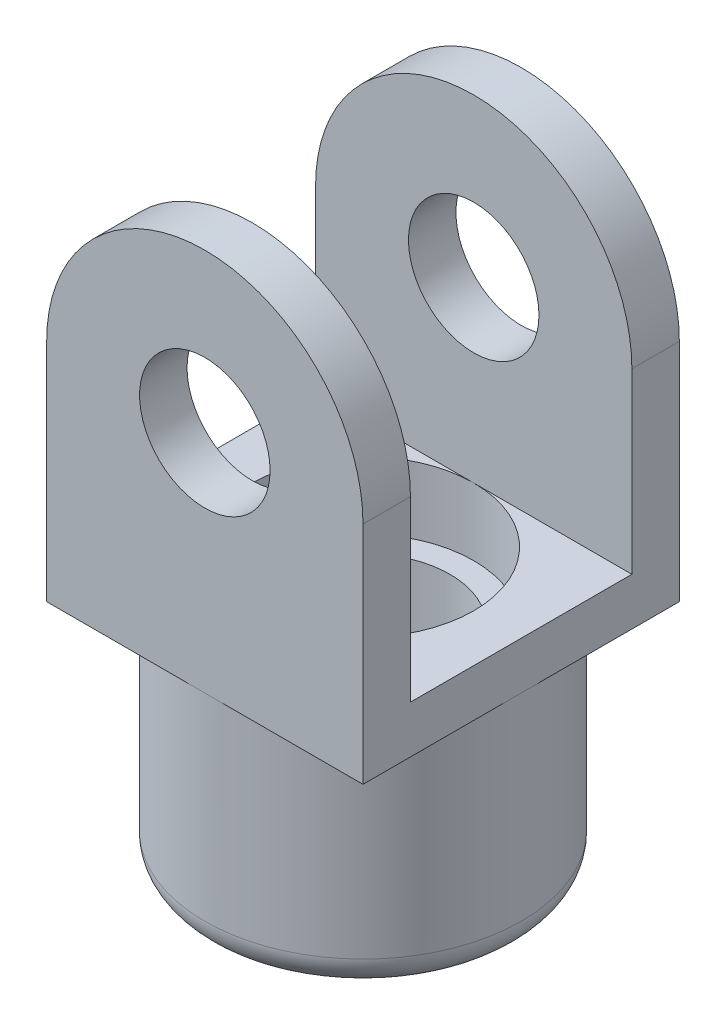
ISO-10303-21;
HEADER;
FILE_DESCRIPTION(('STEP AP214'),'2;1');
FILE_NAME('part.step','',(''),(''),'','','');
FILE_SCHEMA(('AUTOMOTIVE_DESIGN { 1 0 10303 214 1 1 1 1 }'));
ENDSEC;
DATA;
#1=APPLICATION_CONTEXT('core data for automotive mechanical design processes');
#2=APPLICATION_PROTOCOL_DEFINITION('international standard','automotive_design',2000,#1);
#3=PRODUCT_CONTEXT('',#1,'mechanical');
#4=PRODUCT('Part','Part','',(#3));
#5=PRODUCT_RELATED_PRODUCT_CATEGORY('part','',(#4));
#6=PRODUCT_DEFINITION_FORMATION('','',#4);
#7=PRODUCT_DEFINITION_CONTEXT('part definition',#1,'design');
#8=PRODUCT_DEFINITION('design','',#6,#7);
#9=PRODUCT_DEFINITION_SHAPE('','',#8);
#10=(LENGTH_UNIT() NAMED_UNIT(*) SI_UNIT(.MILLI.,.METRE.));
#11=(NAMED_UNIT(*) PLANE_ANGLE_UNIT() SI_UNIT($,.RADIAN.));
#12=(NAMED_UNIT(*) SI_UNIT($,.STERADIAN.) SOLID_ANGLE_UNIT());
#13=UNCERTAINTY_MEASURE_WITH_UNIT(LENGTH_MEASURE(1.E-05),#10,'distance_accuracy_value','');
#14=(GEOMETRIC_REPRESENTATION_CONTEXT(3) GLOBAL_UNCERTAINTY_ASSIGNED_CONTEXT((#13)) GLOBAL_UNIT_ASSIGNED_CONTEXT((#10,
#11,#12)) REPRESENTATION_CONTEXT('',''));
#15=CARTESIAN_POINT('',(0.,0.,0.));
#16=DIRECTION('',(0.,0.,1.));
#17=DIRECTION('',(1.,0.,0.));
#18=AXIS2_PLACEMENT_3D('',#15,#16,#17);
#19=CARTESIAN_POINT('',(0.,12.319,0.));
#20=DIRECTION('',(0.,-1.,0.));
#21=DIRECTION('',(1.,0.,0.));
#22=AXIS2_PLACEMENT_3D('',#19,#20,#21);
#23=CYLINDRICAL_SURFACE('',#22,2.794);
#24=CARTESIAN_POINT('',(0.,-0.634999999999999,0.));
#25=DIRECTION('',(0.,1.,0.));
#26=DIRECTION('',(-1.,0.,0.));
#27=AXIS2_PLACEMENT_3D('',#24,#25,#26);
#28=CIRCLE('',#27,2.794);
#29=CARTESIAN_POINT('',(-2.794,-0.634999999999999,0.));
#30=VERTEX_POINT('',#29);
#31=EDGE_CURVE('E204',#30,#30,#28,.F.);
#32=ORIENTED_EDGE('',*,*,#31,.F.);
#33=EDGE_LOOP('',(#32));
#34=FACE_BOUND('',#33,.T.);
#35=CARTESIAN_POINT('',(0.,-5.207,0.));
#36=DIRECTION('',(0.,-1.,0.));
#37=DIRECTION('',(1.,0.,0.));
#38=AXIS2_PLACEMENT_3D('',#35,#36,#37);
#39=CIRCLE('',#38,2.794);
#40=CARTESIAN_POINT('',(2.794,-5.207,0.));
#41=VERTEX_POINT('',#40);
#42=EDGE_CURVE('E114',#41,#41,#39,.F.);
#43=ORIENTED_EDGE('',*,*,#42,.F.);
#44=EDGE_LOOP('',(#43));
#45=FACE_BOUND('',#44,.T.);
#46=ADVANCED_FACE('F28',(#34,#45),#23,.F.);
#47=CARTESIAN_POINT('',(-5.08,1.524,5.08));
#48=DIRECTION('',(0.,1.,0.));
#49=DIRECTION('',(-1.,0.,0.));
#50=AXIS2_PLACEMENT_3D('',#47,#48,#49);
#51=PLANE('',#50);
#52=CARTESIAN_POINT('',(0.,1.524,0.));
#53=DIRECTION('',(0.,1.,0.));
#54=DIRECTION('',(-1.,0.,0.));
#55=AXIS2_PLACEMENT_3D('',#52,#53,#54);
#56=CIRCLE('',#55,3.556);
#57=CARTESIAN_POINT('',(0.,1.524,3.556));
#58=VERTEX_POINT('',#57);
#59=CARTESIAN_POINT('',(0.,1.524,-3.556));
#60=VERTEX_POINT('',#59);
#61=EDGE_CURVE('E42',#58,#60,#56,.T.);
#62=ORIENTED_EDGE('',*,*,#61,.F.);
#63=DIRECTION('',(1.,0.,0.));
#64=VECTOR('',#63,1.);
#65=CARTESIAN_POINT('',(0.,1.524,3.556));
#66=LINE('',#65,#64);
#67=CARTESIAN_POINT('',(5.08,1.524,3.556));
#68=VERTEX_POINT('',#67);
#69=EDGE_CURVE('E120',#58,#68,#66,.T.);
#70=ORIENTED_EDGE('',*,*,#69,.T.);
#71=DIRECTION('',(0.,0.,-1.));
#72=VECTOR('',#71,1.);
#73=CARTESIAN_POINT('',(5.08,1.524,5.08));
#74=LINE('',#73,#72);
#75=CARTESIAN_POINT('',(5.08,1.524,-3.556));
#76=VERTEX_POINT('',#75);
#77=EDGE_CURVE('E137',#68,#76,#74,.T.);
#78=ORIENTED_EDGE('',*,*,#77,.T.);
#79=DIRECTION('',(1.,0.,0.));
#80=VECTOR('',#79,1.);
#81=CARTESIAN_POINT('',(0.,1.524,-3.556));
#82=LINE('',#81,#80);
#83=EDGE_CURVE('E122',#60,#76,#82,.T.);
#84=ORIENTED_EDGE('',*,*,#83,.F.);
#85=EDGE_LOOP('',(#62,#70,#78,#84));
#86=FACE_BOUND('',#85,.T.);
#87=ADVANCED_FACE('F118',(#86),#51,.T.);
#88=CARTESIAN_POINT('',(-5.08,0.,5.08));
#89=DIRECTION('',(0.,1.,0.));
#90=DIRECTION('',(-1.,0.,0.));
#91=AXIS2_PLACEMENT_3D('',#88,#89,#90);
#92=PLANE('',#91);
#93=CARTESIAN_POINT('',(0.,0.,0.));
#94=DIRECTION('',(0.,-1.,0.));
#95=DIRECTION('',(1.,0.,0.));
#96=AXIS2_PLACEMENT_3D('',#93,#94,#95);
#97=CIRCLE('',#96,5.08);
#98=CARTESIAN_POINT('',(5.08,0.,0.));
#99=VERTEX_POINT('',#98);
#100=CARTESIAN_POINT('',(0.,0.,5.08));
#101=VERTEX_POINT('',#100);
#102=EDGE_CURVE('E207',#99,#101,#97,.T.);
#103=ORIENTED_EDGE('',*,*,#102,.F.);
#104=DIRECTION('',(0.,0.,-1.));
#105=VECTOR('',#104,1.);
#106=CARTESIAN_POINT('',(5.08,0.,5.08));
#107=LINE('',#106,#105);
#108=CARTESIAN_POINT('',(5.08,0.,5.08));
#109=VERTEX_POINT('',#108);
#110=EDGE_CURVE('E190',#109,#99,#107,.T.);
#111=ORIENTED_EDGE('',*,*,#110,.F.);
#112=DIRECTION('',(1.,0.,0.));
#113=VECTOR('',#112,1.);
#114=CARTESIAN_POINT('',(-5.08,0.,5.08));
#115=LINE('',#114,#113);
#116=EDGE_CURVE('E180',#101,#109,#115,.T.);
#117=ORIENTED_EDGE('',*,*,#116,.F.);
#118=EDGE_LOOP('',(#103,#111,#117));
#119=FACE_BOUND('',#118,.T.);
#120=ADVANCED_FACE('F261',(#119),#92,.F.);
#121=CARTESIAN_POINT('',(-5.08,0.,0.));
#122=VERTEX_POINT('',#121);
#123=EDGE_CURVE('E211',#101,#122,#97,.T.);
#124=ORIENTED_EDGE('',*,*,#123,.F.);
#125=CARTESIAN_POINT('',(-5.08,0.,5.08));
#126=VERTEX_POINT('',#125);
#127=EDGE_CURVE('E181',#126,#101,#115,.T.);
#128=ORIENTED_EDGE('',*,*,#127,.F.);
#129=DIRECTION('',(0.,0.,-1.));
#130=VECTOR('',#129,1.);
#131=CARTESIAN_POINT('',(-5.08,0.,5.08));
#132=LINE('',#131,#130);
#133=EDGE_CURVE('E185',#126,#122,#132,.T.);
#134=ORIENTED_EDGE('',*,*,#133,.T.);
#135=EDGE_LOOP('',(#124,#128,#134));
#136=FACE_BOUND('',#135,.T.);
#137=ADVANCED_FACE('F239',(#136),#92,.F.);
#138=CARTESIAN_POINT('',(0.,0.,-5.08));
#139=VERTEX_POINT('',#138);
#140=EDGE_CURVE('E50',#122,#139,#97,.T.);
#141=ORIENTED_EDGE('',*,*,#140,.F.);
#142=CARTESIAN_POINT('',(-5.08,0.,-5.08));
#143=VERTEX_POINT('',#142);
#144=EDGE_CURVE('E189',#122,#143,#132,.T.);
#145=ORIENTED_EDGE('',*,*,#144,.T.);
#146=DIRECTION('',(1.,0.,0.));
#147=VECTOR('',#146,1.);
#148=CARTESIAN_POINT('',(-5.08,0.,-5.08));
#149=LINE('',#148,#147);
#150=EDGE_CURVE('E169',#143,#139,#149,.T.);
#151=ORIENTED_EDGE('',*,*,#150,.T.);
#152=EDGE_LOOP('',(#141,#145,#151));
#153=FACE_BOUND('',#152,.T.);
#154=ADVANCED_FACE('F235',(#153),#92,.F.);
#155=EDGE_CURVE('E188',#139,#99,#97,.T.);
#156=ORIENTED_EDGE('',*,*,#155,.F.);
#157=CARTESIAN_POINT('',(5.08,0.,-5.08));
#158=VERTEX_POINT('',#157);
#159=EDGE_CURVE('E168',#139,#158,#149,.T.);
#160=ORIENTED_EDGE('',*,*,#159,.T.);
#161=EDGE_CURVE('E192',#99,#158,#107,.T.);
#162=ORIENTED_EDGE('',*,*,#161,.F.);
#163=EDGE_LOOP('',(#156,#160,#162));
#164=FACE_BOUND('',#163,.T.);
#165=ADVANCED_FACE('F229',(#164),#92,.F.);
#166=CARTESIAN_POINT('',(-5.08,0.,5.08));
#167=DIRECTION('',(-1.,0.,0.));
#168=DIRECTION('',(0.,-1.,0.));
#169=AXIS2_PLACEMENT_3D('',#166,#167,#168);
#170=PLANE('',#169);
#171=DIRECTION('',(0.,0.,-1.));
#172=VECTOR('',#171,1.);
#173=CARTESIAN_POINT('',(-5.08,1.524,5.08));
#174=LINE('',#173,#172);
#175=CARTESIAN_POINT('',(-5.08,1.524,3.556));
#176=VERTEX_POINT('',#175);
#177=CARTESIAN_POINT('',(-5.08,1.524,-3.556));
#178=VERTEX_POINT('',#177);
#179=EDGE_CURVE('E136',#176,#178,#174,.T.);
#180=ORIENTED_EDGE('',*,*,#179,.T.);
#181=DIRECTION('',(0.,1.,0.));
#182=VECTOR('',#181,1.);
#183=CARTESIAN_POINT('',(-5.08,7.239,-3.556));
#184=LINE('',#183,#182);
#185=CARTESIAN_POINT('',(-5.08,7.239,-3.556));
#186=VERTEX_POINT('',#185);
#187=EDGE_CURVE('E149',#178,#186,#184,.T.);
#188=ORIENTED_EDGE('',*,*,#187,.T.);
#189=DIRECTION('',(0.,0.,-1.));
#190=VECTOR('',#189,1.);
#191=CARTESIAN_POINT('',(-5.08,7.239,5.08));
#192=LINE('',#191,#190);
#193=CARTESIAN_POINT('',(-5.08,7.239,-5.08));
#194=VERTEX_POINT('',#193);
#195=EDGE_CURVE('E184',#186,#194,#192,.T.);
#196=ORIENTED_EDGE('',*,*,#195,.T.);
#197=DIRECTION('',(0.,1.,0.));
#198=VECTOR('',#197,1.);
#199=CARTESIAN_POINT('',(-5.08,0.,-5.08));
#200=LINE('',#199,#198);
#201=EDGE_CURVE('E154',#143,#194,#200,.T.);
#202=ORIENTED_EDGE('',*,*,#201,.F.);
#203=ORIENTED_EDGE('',*,*,#144,.F.);
#204=ORIENTED_EDGE('',*,*,#133,.F.);
#205=DIRECTION('',(0.,1.,0.));
#206=VECTOR('',#205,1.);
#207=CARTESIAN_POINT('',(-5.08,0.,5.08));
#208=LINE('',#207,#206);
#209=CARTESIAN_POINT('',(-5.08,7.239,5.08));
#210=VERTEX_POINT('',#209);
#211=EDGE_CURVE('E171',#126,#210,#208,.T.);
#212=ORIENTED_EDGE('',*,*,#211,.T.);
#213=CARTESIAN_POINT('',(-5.08,7.239,3.556));
#214=VERTEX_POINT('',#213);
#215=EDGE_CURVE('E197',#210,#214,#192,.T.);
#216=ORIENTED_EDGE('',*,*,#215,.T.);
#217=DIRECTION('',(0.,1.,0.));
#218=VECTOR('',#217,1.);
#219=CARTESIAN_POINT('',(-5.08,7.239,3.556));
#220=LINE('',#219,#218);
#221=EDGE_CURVE('E155',#176,#214,#220,.T.);
#222=ORIENTED_EDGE('',*,*,#221,.F.);
#223=EDGE_LOOP('',(#180,#188,#196,#202,#203,#204,#212,#216,#222));
#224=FACE_BOUND('',#223,.T.);
#225=ADVANCED_FACE('F30',(#224),#170,.T.);
#226=CARTESIAN_POINT('',(5.08,7.239,5.08));
#227=DIRECTION('',(1.,0.,0.));
#228=DIRECTION('',(0.,1.,0.));
#229=AXIS2_PLACEMENT_3D('',#226,#227,#228);
#230=PLANE('',#229);
#231=DIRECTION('',(0.,0.,-1.));
#232=VECTOR('',#231,1.);
#233=CARTESIAN_POINT('',(5.08,7.239,5.08));
#234=LINE('',#233,#232);
#235=CARTESIAN_POINT('',(5.08,7.239,-3.556));
#236=VERTEX_POINT('',#235);
#237=CARTESIAN_POINT('',(5.08,7.239,-5.08));
#238=VERTEX_POINT('',#237);
#239=EDGE_CURVE('E196',#236,#238,#234,.T.);
#240=ORIENTED_EDGE('',*,*,#239,.F.);
#241=DIRECTION('',(0.,-1.,0.));
#242=VECTOR('',#241,1.);
#243=CARTESIAN_POINT('',(5.08,7.23900000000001,-3.556));
#244=LINE('',#243,#242);
#245=EDGE_CURVE('E143',#236,#76,#244,.T.);
#246=ORIENTED_EDGE('',*,*,#245,.T.);
#247=ORIENTED_EDGE('',*,*,#77,.F.);
#248=DIRECTION('',(0.,-1.,0.));
#249=VECTOR('',#248,1.);
#250=CARTESIAN_POINT('',(5.08,7.23900000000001,3.556));
#251=LINE('',#250,#249);
#252=CARTESIAN_POINT('',(5.08,7.239,3.556));
#253=VERTEX_POINT('',#252);
#254=EDGE_CURVE('E131',#253,#68,#251,.T.);
#255=ORIENTED_EDGE('',*,*,#254,.F.);
#256=CARTESIAN_POINT('',(5.08,7.239,5.08));
#257=VERTEX_POINT('',#256);
#258=EDGE_CURVE('E193',#257,#253,#234,.T.);
#259=ORIENTED_EDGE('',*,*,#258,.F.);
#260=DIRECTION('',(0.,-1.,0.));
#261=VECTOR('',#260,1.);
#262=CARTESIAN_POINT('',(5.08,7.239,5.08));
#263=LINE('',#262,#261);
#264=EDGE_CURVE('E177',#257,#109,#263,.T.);
#265=ORIENTED_EDGE('',*,*,#264,.T.);
#266=ORIENTED_EDGE('',*,*,#110,.T.);
#267=ORIENTED_EDGE('',*,*,#161,.T.);
#268=DIRECTION('',(0.,-1.,0.));
#269=VECTOR('',#268,1.);
#270=CARTESIAN_POINT('',(5.08,7.239,-5.08));
#271=LINE('',#270,#269);
#272=EDGE_CURVE('E165',#238,#158,#271,.T.);
#273=ORIENTED_EDGE('',*,*,#272,.F.);
#274=EDGE_LOOP('',(#240,#246,#247,#255,#259,#265,#266,#267,#273));
#275=FACE_BOUND('',#274,.T.);
#276=ADVANCED_FACE('F251',(#275),#230,.T.);
#277=CARTESIAN_POINT('',(0.,7.239,5.08));
#278=DIRECTION('',(0.,0.,-1.));
#279=DIRECTION('',(-1.,0.,0.));
#280=AXIS2_PLACEMENT_3D('',#277,#278,#279);
#281=CYLINDRICAL_SURFACE('',#280,5.08);
#282=ORIENTED_EDGE('',*,*,#195,.F.);
#283=CARTESIAN_POINT('',(0.,7.239,-3.556));
#284=DIRECTION('',(0.,0.,-1.));
#285=DIRECTION('',(-1.,0.,0.));
#286=AXIS2_PLACEMENT_3D('',#283,#284,#285);
#287=CIRCLE('',#286,5.08);
#288=EDGE_CURVE('E146',#186,#236,#287,.T.);
#289=ORIENTED_EDGE('',*,*,#288,.T.);
#290=ORIENTED_EDGE('',*,*,#239,.T.);
#291=CARTESIAN_POINT('',(0.,7.239,-5.08));
#292=DIRECTION('',(0.,0.,-1.));
#293=DIRECTION('',(-1.,0.,0.));
#294=AXIS2_PLACEMENT_3D('',#291,#292,#293);
#295=CIRCLE('',#294,5.08);
#296=EDGE_CURVE('E162',#194,#238,#295,.T.);
#297=ORIENTED_EDGE('',*,*,#296,.F.);
#298=EDGE_LOOP('',(#282,#289,#290,#297));
#299=FACE_BOUND('',#298,.T.);
#300=ADVANCED_FACE('F257',(#299),#281,.T.);
#301=CARTESIAN_POINT('',(0.,7.239,3.556));
#302=DIRECTION('',(0.,0.,-1.));
#303=DIRECTION('',(-1.,0.,0.));
#304=AXIS2_PLACEMENT_3D('',#301,#302,#303);
#305=CIRCLE('',#304,5.08);
#306=EDGE_CURVE('E157',#214,#253,#305,.T.);
#307=ORIENTED_EDGE('',*,*,#306,.F.);
#308=ORIENTED_EDGE('',*,*,#215,.F.);
#309=CARTESIAN_POINT('',(0.,7.239,5.08));
#310=DIRECTION('',(0.,0.,-1.));
#311=DIRECTION('',(-1.,0.,0.));
#312=AXIS2_PLACEMENT_3D('',#309,#310,#311);
#313=CIRCLE('',#312,5.08);
#314=EDGE_CURVE('E174',#210,#257,#313,.T.);
#315=ORIENTED_EDGE('',*,*,#314,.T.);
#316=ORIENTED_EDGE('',*,*,#258,.T.);
#317=EDGE_LOOP('',(#307,#308,#315,#316));
#318=FACE_BOUND('',#317,.T.);
#319=ADVANCED_FACE('F248',(#318),#281,.T.);
#320=CARTESIAN_POINT('',(0.,7.239,5.08));
#321=DIRECTION('',(0.,0.,-1.));
#322=DIRECTION('',(-1.,0.,0.));
#323=AXIS2_PLACEMENT_3D('',#320,#321,#322);
#324=PLANE('',#323);
#325=CARTESIAN_POINT('',(0.,7.239,5.08));
#326=DIRECTION('',(0.,0.,1.));
#327=DIRECTION('',(1.,0.,0.));
#328=AXIS2_PLACEMENT_3D('',#325,#326,#327);
#329=CIRCLE('',#328,2.0955);
#330=CARTESIAN_POINT('',(2.0955,7.239,5.08));
#331=VERTEX_POINT('',#330);
#332=EDGE_CURVE('E220',#331,#331,#329,.T.);
#333=ORIENTED_EDGE('',*,*,#332,.F.);
#334=EDGE_LOOP('',(#333));
#335=FACE_BOUND('',#334,.T.);
#336=ORIENTED_EDGE('',*,*,#211,.F.);
#337=ORIENTED_EDGE('',*,*,#127,.T.);
#338=ORIENTED_EDGE('',*,*,#116,.T.);
#339=ORIENTED_EDGE('',*,*,#264,.F.);
#340=ORIENTED_EDGE('',*,*,#314,.F.);
#341=EDGE_LOOP('',(#336,#337,#338,#339,#340));
#342=FACE_BOUND('',#341,.T.);
#343=ADVANCED_FACE('F244',(#335,#342),#324,.F.);
#344=CARTESIAN_POINT('',(0.,7.239,-5.08));
#345=DIRECTION('',(0.,0.,-1.));
#346=DIRECTION('',(-1.,0.,0.));
#347=AXIS2_PLACEMENT_3D('',#344,#345,#346);
#348=PLANE('',#347);
#349=CARTESIAN_POINT('',(0.,7.239,-5.08));
#350=DIRECTION('',(0.,0.,1.));
#351=DIRECTION('',(1.,0.,0.));
#352=AXIS2_PLACEMENT_3D('',#349,#350,#351);
#353=CIRCLE('',#352,2.0955);
#354=CARTESIAN_POINT('',(2.0955,7.239,-5.08));
#355=VERTEX_POINT('',#354);
#356=EDGE_CURVE('E203',#355,#355,#353,.T.);
#357=ORIENTED_EDGE('',*,*,#356,.T.);
#358=EDGE_LOOP('',(#357));
#359=FACE_BOUND('',#358,.T.);
#360=ORIENTED_EDGE('',*,*,#201,.T.);
#361=ORIENTED_EDGE('',*,*,#296,.T.);
#362=ORIENTED_EDGE('',*,*,#272,.T.);
#363=ORIENTED_EDGE('',*,*,#159,.F.);
#364=ORIENTED_EDGE('',*,*,#150,.F.);
#365=EDGE_LOOP('',(#360,#361,#362,#363,#364));
#366=FACE_BOUND('',#365,.T.);
#367=ADVANCED_FACE('F232',(#359,#366),#348,.T.);
#368=EDGE_CURVE('E109',#60,#58,#56,.T.);
#369=ORIENTED_EDGE('',*,*,#368,.F.);
#370=EDGE_CURVE('E140',#178,#60,#82,.T.);
#371=ORIENTED_EDGE('',*,*,#370,.F.);
#372=ORIENTED_EDGE('',*,*,#179,.F.);
#373=EDGE_CURVE('E128',#176,#58,#66,.T.);
#374=ORIENTED_EDGE('',*,*,#373,.T.);
#375=EDGE_LOOP('',(#369,#371,#372,#374));
#376=FACE_BOUND('',#375,.T.);
#377=ADVANCED_FACE('F134',(#376),#51,.T.);
#378=CARTESIAN_POINT('',(0.,7.239,3.556));
#379=DIRECTION('',(0.,0.,-1.));
#380=DIRECTION('',(-1.,0.,0.));
#381=AXIS2_PLACEMENT_3D('',#378,#379,#380);
#382=PLANE('',#381);
#383=CARTESIAN_POINT('',(0.,7.239,3.556));
#384=DIRECTION('',(0.,0.,-1.));
#385=DIRECTION('',(-1.,0.,0.));
#386=AXIS2_PLACEMENT_3D('',#383,#384,#385);
#387=CIRCLE('',#386,2.0955);
#388=CARTESIAN_POINT('',(-2.0955,7.239,3.556));
#389=VERTEX_POINT('',#388);
#390=EDGE_CURVE('E152',#389,#389,#387,.T.);
#391=ORIENTED_EDGE('',*,*,#390,.F.);
#392=EDGE_LOOP('',(#391));
#393=FACE_BOUND('',#392,.T.);
#394=ORIENTED_EDGE('',*,*,#221,.T.);
#395=ORIENTED_EDGE('',*,*,#306,.T.);
#396=ORIENTED_EDGE('',*,*,#254,.T.);
#397=ORIENTED_EDGE('',*,*,#69,.F.);
#398=ORIENTED_EDGE('',*,*,#373,.F.);
#399=EDGE_LOOP('',(#394,#395,#396,#397,#398));
#400=FACE_BOUND('',#399,.T.);
#401=ADVANCED_FACE('F127',(#393,#400),#382,.T.);
#402=CARTESIAN_POINT('',(0.,7.239,-3.556));
#403=DIRECTION('',(0.,0.,-1.));
#404=DIRECTION('',(-1.,0.,0.));
#405=AXIS2_PLACEMENT_3D('',#402,#403,#404);
#406=PLANE('',#405);
#407=CARTESIAN_POINT('',(0.,7.239,-3.556));
#408=DIRECTION('',(0.,0.,-1.));
#409=DIRECTION('',(-1.,0.,0.));
#410=AXIS2_PLACEMENT_3D('',#407,#408,#409);
#411=CIRCLE('',#410,2.0955);
#412=CARTESIAN_POINT('',(-2.0955,7.239,-3.556));
#413=VERTEX_POINT('',#412);
#414=EDGE_CURVE('E200',#413,#413,#411,.T.);
#415=ORIENTED_EDGE('',*,*,#414,.T.);
#416=EDGE_LOOP('',(#415));
#417=FACE_BOUND('',#416,.T.);
#418=ORIENTED_EDGE('',*,*,#187,.F.);
#419=ORIENTED_EDGE('',*,*,#370,.T.);
#420=ORIENTED_EDGE('',*,*,#83,.T.);
#421=ORIENTED_EDGE('',*,*,#245,.F.);
#422=ORIENTED_EDGE('',*,*,#288,.F.);
#423=EDGE_LOOP('',(#418,#419,#420,#421,#422));
#424=FACE_BOUND('',#423,.T.);
#425=ADVANCED_FACE('F254',(#417,#424),#406,.F.);
#426=CARTESIAN_POINT('',(0.,7.239,-5.08));
#427=DIRECTION('',(0.,0.,1.));
#428=DIRECTION('',(1.,0.,0.));
#429=AXIS2_PLACEMENT_3D('',#426,#427,#428);
#430=CYLINDRICAL_SURFACE('',#429,2.0955);
#431=ORIENTED_EDGE('',*,*,#356,.F.);
#432=EDGE_LOOP('',(#431));
#433=FACE_BOUND('',#432,.T.);
#434=ORIENTED_EDGE('',*,*,#414,.F.);
#435=EDGE_LOOP('',(#434));
#436=FACE_BOUND('',#435,.T.);
#437=ADVANCED_FACE('F293',(#433,#436),#430,.F.);
#438=ORIENTED_EDGE('',*,*,#390,.T.);
#439=EDGE_LOOP('',(#438));
#440=FACE_BOUND('',#439,.T.);
#441=ORIENTED_EDGE('',*,*,#332,.T.);
#442=EDGE_LOOP('',(#441));
#443=FACE_BOUND('',#442,.T.);
#444=ADVANCED_FACE('F291',(#440,#443),#430,.F.);
#445=CARTESIAN_POINT('',(0.,-7.366,0.));
#446=DIRECTION('',(0.,1.,0.));
#447=DIRECTION('',(-1.,0.,0.));
#448=AXIS2_PLACEMENT_3D('',#445,#446,#447);
#449=CYLINDRICAL_SURFACE('',#448,5.08);
#450=CARTESIAN_POINT('',(0.,-6.35,0.));
#451=DIRECTION('',(0.,-1.,0.));
#452=DIRECTION('',(1.,0.,0.));
#453=AXIS2_PLACEMENT_3D('',#450,#451,#452);
#454=CIRCLE('',#453,5.08);
#455=CARTESIAN_POINT('',(5.08,-6.35,0.));
#456=VERTEX_POINT('',#455);
#457=EDGE_CURVE('E11',#456,#456,#454,.F.);
#458=ORIENTED_EDGE('',*,*,#457,.T.);
#459=EDGE_LOOP('',(#458));
#460=FACE_BOUND('',#459,.T.);
#461=ORIENTED_EDGE('',*,*,#102,.T.);
#462=ORIENTED_EDGE('',*,*,#123,.T.);
#463=ORIENTED_EDGE('',*,*,#140,.T.);
#464=ORIENTED_EDGE('',*,*,#155,.T.);
#465=EDGE_LOOP('',(#461,#462,#463,#464));
#466=FACE_BOUND('',#465,.T.);
#467=ADVANCED_FACE('F224',(#460,#466),#449,.T.);
#468=CARTESIAN_POINT('',(0.,-7.366,0.));
#469=DIRECTION('',(0.,-1.,0.));
#470=DIRECTION('',(1.,0.,0.));
#471=AXIS2_PLACEMENT_3D('',#468,#469,#470);
#472=PLANE('',#471);
#473=CARTESIAN_POINT('',(0.,-7.366,0.));
#474=DIRECTION('',(0.,-1.,0.));
#475=DIRECTION('',(1.,0.,0.));
#476=AXIS2_PLACEMENT_3D('',#473,#474,#475);
#477=CIRCLE('',#476,4.064);
#478=CARTESIAN_POINT('',(4.064,-7.366,0.));
#479=VERTEX_POINT('',#478);
#480=EDGE_CURVE('E36',#479,#479,#477,.T.);
#481=ORIENTED_EDGE('',*,*,#480,.T.);
#482=EDGE_LOOP('',(#481));
#483=FACE_BOUND('',#482,.T.);
#484=CARTESIAN_POINT('',(0.,-7.366,0.));
#485=DIRECTION('',(0.,-1.,0.));
#486=DIRECTION('',(1.,0.,0.));
#487=AXIS2_PLACEMENT_3D('',#484,#485,#486);
#488=CIRCLE('',#487,3.937);
#489=CARTESIAN_POINT('',(3.937,-7.366,0.));
#490=VERTEX_POINT('',#489);
#491=EDGE_CURVE('E396',#490,#490,#488,.T.);
#492=ORIENTED_EDGE('',*,*,#491,.F.);
#493=EDGE_LOOP('',(#492));
#494=FACE_BOUND('',#493,.T.);
#495=ADVANCED_FACE('F285',(#483,#494),#472,.T.);
#496=CARTESIAN_POINT('',(0.,-0.634999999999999,0.));
#497=DIRECTION('',(0.,1.,0.));
#498=DIRECTION('',(-1.,0.,0.));
#499=AXIS2_PLACEMENT_3D('',#496,#497,#498);
#500=PLANE('',#499);
#501=CARTESIAN_POINT('',(0.,-0.634999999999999,0.));
#502=DIRECTION('',(0.,1.,0.));
#503=DIRECTION('',(-1.,0.,0.));
#504=AXIS2_PLACEMENT_3D('',#501,#502,#503);
#505=CIRCLE('',#504,3.556);
#506=CARTESIAN_POINT('',(-3.556,-0.634999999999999,0.));
#507=VERTEX_POINT('',#506);
#508=EDGE_CURVE('E124',#507,#507,#505,.T.);
#509=ORIENTED_EDGE('',*,*,#508,.T.);
#510=EDGE_LOOP('',(#509));
#511=FACE_BOUND('',#510,.T.);
#512=ORIENTED_EDGE('',*,*,#31,.T.);
#513=EDGE_LOOP('',(#512));
#514=FACE_BOUND('',#513,.T.);
#515=ADVANCED_FACE('F288',(#511,#514),#500,.T.);
#516=CARTESIAN_POINT('',(0.,-0.634999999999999,0.));
#517=DIRECTION('',(0.,1.,0.));
#518=DIRECTION('',(-1.,0.,0.));
#519=AXIS2_PLACEMENT_3D('',#516,#517,#518);
#520=CYLINDRICAL_SURFACE('',#519,3.556);
#521=ORIENTED_EDGE('',*,*,#508,.F.);
#522=EDGE_LOOP('',(#521));
#523=FACE_BOUND('',#522,.T.);
#524=ORIENTED_EDGE('',*,*,#61,.T.);
#525=ORIENTED_EDGE('',*,*,#368,.T.);
#526=EDGE_LOOP('',(#524,#525));
#527=FACE_BOUND('',#526,.T.);
#528=ADVANCED_FACE('F110',(#523,#527),#520,.F.);
#529=CARTESIAN_POINT('',(0.,-5.207,0.));
#530=DIRECTION('',(0.,-1.,0.));
#531=DIRECTION('',(1.,0.,0.));
#532=AXIS2_PLACEMENT_3D('',#529,#530,#531);
#533=PLANE('',#532);
#534=CARTESIAN_POINT('',(0.,-5.207,0.));
#535=DIRECTION('',(0.,-1.,0.));
#536=DIRECTION('',(1.,0.,0.));
#537=AXIS2_PLACEMENT_3D('',#534,#535,#536);
#538=CIRCLE('',#537,3.937);
#539=CARTESIAN_POINT('',(3.937,-5.207,0.));
#540=VERTEX_POINT('',#539);
#541=EDGE_CURVE('E209',#540,#540,#538,.T.);
#542=ORIENTED_EDGE('',*,*,#541,.T.);
#543=EDGE_LOOP('',(#542));
#544=FACE_BOUND('',#543,.T.);
#545=ORIENTED_EDGE('',*,*,#42,.T.);
#546=EDGE_LOOP('',(#545));
#547=FACE_BOUND('',#546,.T.);
#548=ADVANCED_FACE('F364',(#544,#547),#533,.T.);
#549=CARTESIAN_POINT('',(0.,-5.207,0.));
#550=DIRECTION('',(0.,-1.,0.));
#551=DIRECTION('',(1.,0.,0.));
#552=AXIS2_PLACEMENT_3D('',#549,#550,#551);
#553=CYLINDRICAL_SURFACE('',#552,3.937);
#554=ORIENTED_EDGE('',*,*,#541,.F.);
#555=EDGE_LOOP('',(#554));
#556=FACE_BOUND('',#555,.T.);
#557=ORIENTED_EDGE('',*,*,#491,.T.);
#558=EDGE_LOOP('',(#557));
#559=FACE_BOUND('',#558,.T.);
#560=ADVANCED_FACE('F373',(#556,#559),#553,.F.);
#561=CARTESIAN_POINT('',(0.,-6.35,0.));
#562=DIRECTION('',(0.,-1.,0.));
#563=DIRECTION('',(1.,0.,0.));
#564=AXIS2_PLACEMENT_3D('',#561,#562,#563);
#565=TOROIDAL_SURFACE('',#564,4.064,1.016);
#566=ORIENTED_EDGE('',*,*,#457,.F.);
#567=EDGE_LOOP('',(#566));
#568=FACE_BOUND('',#567,.T.);
#569=ORIENTED_EDGE('',*,*,#480,.F.);
#570=EDGE_LOOP('',(#569));
#571=FACE_BOUND('',#570,.T.);
#572=ADVANCED_FACE('F380',(#568,#571),#565,.T.);
#573=CLOSED_SHELL('',(#46,#87,#120,#137,#154,#165,#225,#276,#300,#319,#343,#367,#377,#401,#425,
#437,#444,#467,#495,#515,#528,#548,#560,#572));
#574=MANIFOLD_SOLID_BREP('B2',#573);
#575=ADVANCED_BREP_SHAPE_REPRESENTATION('',(#18,#574),#14);
#576=SHAPE_DEFINITION_REPRESENTATION(#9,#575);
ENDSEC;
END-ISO-10303-21;
